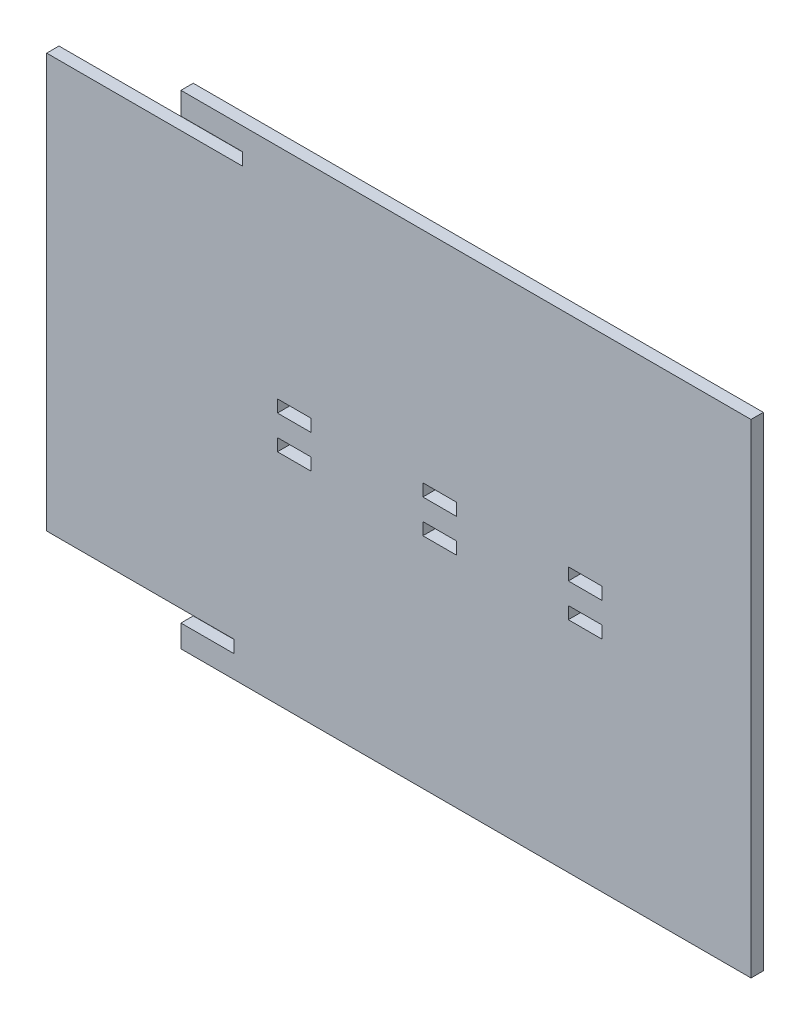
ISO-10303-21;
HEADER;
FILE_DESCRIPTION(('STEP AP214'),'2;1');
FILE_NAME('part.step','',(''),(''),'','','');
FILE_SCHEMA(('AUTOMOTIVE_DESIGN { 1 0 10303 214 1 1 1 1 }'));
ENDSEC;
DATA;
#1=APPLICATION_CONTEXT('core data for automotive mechanical design processes');
#2=APPLICATION_PROTOCOL_DEFINITION('international standard','automotive_design',2000,#1);
#3=PRODUCT_CONTEXT('',#1,'mechanical');
#4=PRODUCT('Part','Part','',(#3));
#5=PRODUCT_RELATED_PRODUCT_CATEGORY('part','',(#4));
#6=PRODUCT_DEFINITION_FORMATION('','',#4);
#7=PRODUCT_DEFINITION_CONTEXT('part definition',#1,'design');
#8=PRODUCT_DEFINITION('design','',#6,#7);
#9=PRODUCT_DEFINITION_SHAPE('','',#8);
#10=(LENGTH_UNIT() NAMED_UNIT(*) SI_UNIT(.MILLI.,.METRE.));
#11=(NAMED_UNIT(*) PLANE_ANGLE_UNIT() SI_UNIT($,.RADIAN.));
#12=(NAMED_UNIT(*) SI_UNIT($,.STERADIAN.) SOLID_ANGLE_UNIT());
#13=UNCERTAINTY_MEASURE_WITH_UNIT(LENGTH_MEASURE(1.E-05),#10,'distance_accuracy_value','');
#14=(GEOMETRIC_REPRESENTATION_CONTEXT(3) GLOBAL_UNCERTAINTY_ASSIGNED_CONTEXT((#13)) GLOBAL_UNIT_ASSIGNED_CONTEXT((#10,
#11,#12)) REPRESENTATION_CONTEXT('',''));
#15=CARTESIAN_POINT('',(0.,0.,0.));
#16=DIRECTION('',(0.,0.,1.));
#17=DIRECTION('',(1.,0.,0.));
#18=AXIS2_PLACEMENT_3D('',#15,#16,#17);
#19=CARTESIAN_POINT('',(0.,0.,5.5));
#20=DIRECTION('',(0.,0.,-1.));
#21=DIRECTION('',(-1.,0.,0.));
#22=AXIS2_PLACEMENT_3D('',#19,#20,#21);
#23=PLANE('',#22);
#24=DIRECTION('',(1.,0.,0.));
#25=VECTOR('',#24,1.);
#26=CARTESIAN_POINT('',(0.,-113.05,5.5));
#27=LINE('',#26,#25);
#28=CARTESIAN_POINT('',(-119.337001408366,-113.05,5.5));
#29=VERTEX_POINT('',#28);
#30=CARTESIAN_POINT('',(-104.337001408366,-113.05,5.5));
#31=VERTEX_POINT('',#30);
#32=EDGE_CURVE('E60',#29,#31,#27,.T.);
#33=ORIENTED_EDGE('',*,*,#32,.T.);
#34=DIRECTION('',(0.,1.,0.));
#35=VECTOR('',#34,1.);
#36=CARTESIAN_POINT('',(-104.337001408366,0.,5.5));
#37=LINE('',#36,#35);
#38=CARTESIAN_POINT('',(-104.337001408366,-118.55,5.5));
#39=VERTEX_POINT('',#38);
#40=EDGE_CURVE('E318',#39,#31,#37,.T.);
#41=ORIENTED_EDGE('',*,*,#40,.F.);
#42=DIRECTION('',(1.,0.,0.));
#43=VECTOR('',#42,1.);
#44=CARTESIAN_POINT('',(0.,-118.55,5.5));
#45=LINE('',#44,#43);
#46=CARTESIAN_POINT('',(-119.337001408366,-118.55,5.5));
#47=VERTEX_POINT('',#46);
#48=EDGE_CURVE('E332',#47,#39,#45,.T.);
#49=ORIENTED_EDGE('',*,*,#48,.F.);
#50=DIRECTION('',(0.,1.,0.));
#51=VECTOR('',#50,1.);
#52=CARTESIAN_POINT('',(-119.337001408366,0.,5.5));
#53=LINE('',#52,#51);
#54=EDGE_CURVE('E328',#47,#29,#53,.T.);
#55=ORIENTED_EDGE('',*,*,#54,.T.);
#56=EDGE_LOOP('',(#33,#41,#49,#55));
#57=FACE_BOUND('',#56,.T.);
#58=DIRECTION('',(0.,1.,0.));
#59=VECTOR('',#58,1.);
#60=CARTESIAN_POINT('',(-54.337001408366,0.,5.5));
#61=LINE('',#60,#59);
#62=CARTESIAN_POINT('',(-54.337001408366,-118.55,5.5));
#63=VERTEX_POINT('',#62);
#64=CARTESIAN_POINT('',(-54.337001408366,-113.05,5.5));
#65=VERTEX_POINT('',#64);
#66=EDGE_CURVE('E384',#63,#65,#61,.T.);
#67=ORIENTED_EDGE('',*,*,#66,.T.);
#68=DIRECTION('',(1.,0.,0.));
#69=VECTOR('',#68,1.);
#70=CARTESIAN_POINT('',(0.,-113.05,5.5));
#71=LINE('',#70,#69);
#72=CARTESIAN_POINT('',(-39.337001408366,-113.05,5.5));
#73=VERTEX_POINT('',#72);
#74=EDGE_CURVE('E375',#65,#73,#71,.T.);
#75=ORIENTED_EDGE('',*,*,#74,.T.);
#76=DIRECTION('',(0.,1.,0.));
#77=VECTOR('',#76,1.);
#78=CARTESIAN_POINT('',(-39.337001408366,0.,5.5));
#79=LINE('',#78,#77);
#80=CARTESIAN_POINT('',(-39.337001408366,-118.55,5.5));
#81=VERTEX_POINT('',#80);
#82=EDGE_CURVE('E391',#81,#73,#79,.T.);
#83=ORIENTED_EDGE('',*,*,#82,.F.);
#84=DIRECTION('',(1.,0.,0.));
#85=VECTOR('',#84,1.);
#86=CARTESIAN_POINT('',(-1.09680782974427E-13,-118.55,5.5));
#87=LINE('',#86,#85);
#88=EDGE_CURVE('E387',#63,#81,#87,.T.);
#89=ORIENTED_EDGE('',*,*,#88,.F.);
#90=EDGE_LOOP('',(#67,#75,#83,#89));
#91=FACE_BOUND('',#90,.T.);
#92=DIRECTION('',(0.,-1.,0.));
#93=VECTOR('',#92,1.);
#94=CARTESIAN_POINT('',(-39.337001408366,0.,5.5));
#95=LINE('',#94,#93);
#96=CARTESIAN_POINT('',(-39.337001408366,-98.0500000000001,5.5));
#97=VERTEX_POINT('',#96);
#98=CARTESIAN_POINT('',(-39.337001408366,-103.55,5.5));
#99=VERTEX_POINT('',#98);
#100=EDGE_CURVE('E399',#97,#99,#95,.T.);
#101=ORIENTED_EDGE('',*,*,#100,.T.);
#102=DIRECTION('',(1.,0.,0.));
#103=VECTOR('',#102,1.);
#104=CARTESIAN_POINT('',(0.,-103.55,5.5));
#105=LINE('',#104,#103);
#106=CARTESIAN_POINT('',(-54.337001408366,-103.55,5.5));
#107=VERTEX_POINT('',#106);
#108=EDGE_CURVE('E438',#107,#99,#105,.T.);
#109=ORIENTED_EDGE('',*,*,#108,.F.);
#110=DIRECTION('',(0.,-1.,0.));
#111=VECTOR('',#110,1.);
#112=CARTESIAN_POINT('',(-54.337001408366,0.,5.5));
#113=LINE('',#112,#111);
#114=CARTESIAN_POINT('',(-54.337001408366,-98.0500000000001,5.5));
#115=VERTEX_POINT('',#114);
#116=EDGE_CURVE('E452',#115,#107,#113,.T.);
#117=ORIENTED_EDGE('',*,*,#116,.F.);
#118=DIRECTION('',(1.,0.,0.));
#119=VECTOR('',#118,1.);
#120=CARTESIAN_POINT('',(0.,-98.0500000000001,5.5));
#121=LINE('',#120,#119);
#122=EDGE_CURVE('E449',#115,#97,#121,.T.);
#123=ORIENTED_EDGE('',*,*,#122,.T.);
#124=EDGE_LOOP('',(#101,#109,#117,#123));
#125=FACE_BOUND('',#124,.T.);
#126=DIRECTION('',(-1.,0.,0.));
#127=VECTOR('',#126,1.);
#128=CARTESIAN_POINT('',(-227.473920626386,-0.200000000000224,5.5));
#129=LINE('',#128,#127);
#130=CARTESIAN_POINT('',(27.3311582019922,-0.20000000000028,5.5));
#131=VERTEX_POINT('',#130);
#132=CARTESIAN_POINT('',(-227.473920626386,-0.200000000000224,5.5));
#133=VERTEX_POINT('',#132);
#134=EDGE_CURVE('E466',#131,#133,#129,.T.);
#135=ORIENTED_EDGE('',*,*,#134,.T.);
#136=DIRECTION('',(0.,-1.,0.));
#137=VECTOR('',#136,1.);
#138=CARTESIAN_POINT('',(-227.473920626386,-10.2000000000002,5.5));
#139=LINE('',#138,#137);
#140=CARTESIAN_POINT('',(-227.473920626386,-10.2000000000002,5.5));
#141=VERTEX_POINT('',#140);
#142=EDGE_CURVE('E469',#133,#141,#139,.T.);
#143=ORIENTED_EDGE('',*,*,#142,.T.);
#144=DIRECTION('',(1.,0.,0.));
#145=VECTOR('',#144,1.);
#146=CARTESIAN_POINT('',(-200.,-10.2000000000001,5.5));
#147=LINE('',#146,#145);
#148=CARTESIAN_POINT('',(-200.,-10.2000000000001,5.5));
#149=VERTEX_POINT('',#148);
#150=EDGE_CURVE('E472',#141,#149,#147,.T.);
#151=ORIENTED_EDGE('',*,*,#150,.T.);
#152=DIRECTION('',(0.,-1.,0.));
#153=VECTOR('',#152,1.);
#154=CARTESIAN_POINT('',(-200.,-15.8000000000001,5.5));
#155=LINE('',#154,#153);
#156=CARTESIAN_POINT('',(-200.,-15.8000000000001,5.5));
#157=VERTEX_POINT('',#156);
#158=EDGE_CURVE('E474',#149,#157,#155,.T.);
#159=ORIENTED_EDGE('',*,*,#158,.T.);
#160=DIRECTION('',(-1.,0.,0.));
#161=VECTOR('',#160,1.);
#162=CARTESIAN_POINT('',(-287.473920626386,-15.8000000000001,5.5));
#163=LINE('',#162,#161);
#164=CARTESIAN_POINT('',(-287.473920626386,-15.8000000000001,5.5));
#165=VERTEX_POINT('',#164);
#166=EDGE_CURVE('E476',#157,#165,#163,.T.);
#167=ORIENTED_EDGE('',*,*,#166,.T.);
#168=DIRECTION('',(0.,-1.,0.));
#169=VECTOR('',#168,1.);
#170=CARTESIAN_POINT('',(-287.473920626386,-200.8,5.5));
#171=LINE('',#170,#169);
#172=CARTESIAN_POINT('',(-287.473920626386,-200.8,5.5));
#173=VERTEX_POINT('',#172);
#174=EDGE_CURVE('E478',#165,#173,#171,.T.);
#175=ORIENTED_EDGE('',*,*,#174,.T.);
#176=DIRECTION('',(1.,0.,0.));
#177=VECTOR('',#176,1.);
#178=CARTESIAN_POINT('',(-203.831058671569,-200.8,5.5));
#179=LINE('',#178,#177);
#180=CARTESIAN_POINT('',(-203.831058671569,-200.8,5.5));
#181=VERTEX_POINT('',#180);
#182=EDGE_CURVE('E480',#173,#181,#179,.T.);
#183=ORIENTED_EDGE('',*,*,#182,.T.);
#184=DIRECTION('',(0.,-1.,0.));
#185=VECTOR('',#184,1.);
#186=CARTESIAN_POINT('',(-203.831058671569,-206.4,5.5));
#187=LINE('',#186,#185);
#188=CARTESIAN_POINT('',(-203.831058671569,-206.4,5.5));
#189=VERTEX_POINT('',#188);
#190=EDGE_CURVE('E482',#181,#189,#187,.T.);
#191=ORIENTED_EDGE('',*,*,#190,.T.);
#192=DIRECTION('',(-1.,0.,0.));
#193=VECTOR('',#192,1.);
#194=CARTESIAN_POINT('',(-227.473920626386,-206.4,5.5));
#195=LINE('',#194,#193);
#196=CARTESIAN_POINT('',(-227.473920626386,-206.4,5.5));
#197=VERTEX_POINT('',#196);
#198=EDGE_CURVE('E484',#189,#197,#195,.T.);
#199=ORIENTED_EDGE('',*,*,#198,.T.);
#200=DIRECTION('',(0.,-1.,0.));
#201=VECTOR('',#200,1.);
#202=CARTESIAN_POINT('',(-227.473920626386,-216.4,5.5));
#203=LINE('',#202,#201);
#204=CARTESIAN_POINT('',(-227.473920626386,-216.4,5.5));
#205=VERTEX_POINT('',#204);
#206=EDGE_CURVE('E486',#197,#205,#203,.T.);
#207=ORIENTED_EDGE('',*,*,#206,.T.);
#208=DIRECTION('',(1.,0.,0.));
#209=VECTOR('',#208,1.);
#210=CARTESIAN_POINT('',(27.3311582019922,-216.4,5.5));
#211=LINE('',#210,#209);
#212=CARTESIAN_POINT('',(27.3311582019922,-216.4,5.5));
#213=VERTEX_POINT('',#212);
#214=EDGE_CURVE('E488',#205,#213,#211,.T.);
#215=ORIENTED_EDGE('',*,*,#214,.T.);
#216=DIRECTION('',(0.,1.,0.));
#217=VECTOR('',#216,1.);
#218=CARTESIAN_POINT('',(27.3311582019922,-0.20000000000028,5.5));
#219=LINE('',#218,#217);
#220=EDGE_CURVE('E490',#213,#131,#219,.T.);
#221=ORIENTED_EDGE('',*,*,#220,.T.);
#222=EDGE_LOOP('',(#135,#143,#151,#159,#167,#175,#183,#191,#199,#207,#215,#221));
#223=FACE_BOUND('',#222,.T.);
#224=DIRECTION('',(0.,-1.,0.));
#225=VECTOR('',#224,1.);
#226=CARTESIAN_POINT('',(-169.337001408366,0.,5.5));
#227=LINE('',#226,#225);
#228=CARTESIAN_POINT('',(-169.337001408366,-98.0500000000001,5.5));
#229=VERTEX_POINT('',#228);
#230=CARTESIAN_POINT('',(-169.337001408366,-103.55,5.5));
#231=VERTEX_POINT('',#230);
#232=EDGE_CURVE('E290',#229,#231,#227,.T.);
#233=ORIENTED_EDGE('',*,*,#232,.T.);
#234=DIRECTION('',(1.,0.,0.));
#235=VECTOR('',#234,1.);
#236=CARTESIAN_POINT('',(0.,-103.55,5.5));
#237=LINE('',#236,#235);
#238=CARTESIAN_POINT('',(-184.337001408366,-103.55,5.5));
#239=VERTEX_POINT('',#238);
#240=EDGE_CURVE('E297',#239,#231,#237,.T.);
#241=ORIENTED_EDGE('',*,*,#240,.F.);
#242=DIRECTION('',(0.,-1.,0.));
#243=VECTOR('',#242,1.);
#244=CARTESIAN_POINT('',(-184.337001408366,0.,5.5));
#245=LINE('',#244,#243);
#246=CARTESIAN_POINT('',(-184.337001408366,-98.0500000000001,5.5));
#247=VERTEX_POINT('',#246);
#248=EDGE_CURVE('E300',#247,#239,#245,.T.);
#249=ORIENTED_EDGE('',*,*,#248,.F.);
#250=DIRECTION('',(1.,0.,0.));
#251=VECTOR('',#250,1.);
#252=CARTESIAN_POINT('',(0.,-98.0500000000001,5.5));
#253=LINE('',#252,#251);
#254=EDGE_CURVE('E306',#247,#229,#253,.T.);
#255=ORIENTED_EDGE('',*,*,#254,.T.);
#256=EDGE_LOOP('',(#233,#241,#249,#255));
#257=FACE_BOUND('',#256,.T.);
#258=DIRECTION('',(0.,-1.,0.));
#259=VECTOR('',#258,1.);
#260=CARTESIAN_POINT('',(-104.337001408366,0.,5.5));
#261=LINE('',#260,#259);
#262=CARTESIAN_POINT('',(-104.337001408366,-98.0500000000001,5.5));
#263=VERTEX_POINT('',#262);
#264=CARTESIAN_POINT('',(-104.337001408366,-103.55,5.5));
#265=VERTEX_POINT('',#264);
#266=EDGE_CURVE('E339',#263,#265,#261,.T.);
#267=ORIENTED_EDGE('',*,*,#266,.T.);
#268=DIRECTION('',(1.,0.,0.));
#269=VECTOR('',#268,1.);
#270=CARTESIAN_POINT('',(0.,-103.55,5.5));
#271=LINE('',#270,#269);
#272=CARTESIAN_POINT('',(-119.337001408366,-103.55,5.5));
#273=VERTEX_POINT('',#272);
#274=EDGE_CURVE('E409',#273,#265,#271,.T.);
#275=ORIENTED_EDGE('',*,*,#274,.F.);
#276=DIRECTION('',(0.,-1.,0.));
#277=VECTOR('',#276,1.);
#278=CARTESIAN_POINT('',(-119.337001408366,0.,5.5));
#279=LINE('',#278,#277);
#280=CARTESIAN_POINT('',(-119.337001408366,-98.0500000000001,5.5));
#281=VERTEX_POINT('',#280);
#282=EDGE_CURVE('E423',#281,#273,#279,.T.);
#283=ORIENTED_EDGE('',*,*,#282,.F.);
#284=DIRECTION('',(1.,0.,0.));
#285=VECTOR('',#284,1.);
#286=CARTESIAN_POINT('',(0.,-98.0500000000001,5.5));
#287=LINE('',#286,#285);
#288=EDGE_CURVE('E420',#281,#263,#287,.T.);
#289=ORIENTED_EDGE('',*,*,#288,.T.);
#290=EDGE_LOOP('',(#267,#275,#283,#289));
#291=FACE_BOUND('',#290,.T.);
#292=DIRECTION('',(1.,0.,0.));
#293=VECTOR('',#292,1.);
#294=CARTESIAN_POINT('',(0.,-113.05,5.5));
#295=LINE('',#294,#293);
#296=CARTESIAN_POINT('',(-184.337001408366,-113.05,5.5));
#297=VERTEX_POINT('',#296);
#298=CARTESIAN_POINT('',(-169.337001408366,-113.05,5.5));
#299=VERTEX_POINT('',#298);
#300=EDGE_CURVE('E52',#297,#299,#295,.T.);
#301=ORIENTED_EDGE('',*,*,#300,.T.);
#302=DIRECTION('',(0.,1.,0.));
#303=VECTOR('',#302,1.);
#304=CARTESIAN_POINT('',(-169.337001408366,0.,5.5));
#305=LINE('',#304,#303);
#306=CARTESIAN_POINT('',(-169.337001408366,-118.55,5.5));
#307=VERTEX_POINT('',#306);
#308=EDGE_CURVE('E348',#307,#299,#305,.T.);
#309=ORIENTED_EDGE('',*,*,#308,.F.);
#310=DIRECTION('',(1.,0.,0.));
#311=VECTOR('',#310,1.);
#312=CARTESIAN_POINT('',(0.,-118.55,5.5));
#313=LINE('',#312,#311);
#314=CARTESIAN_POINT('',(-184.337001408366,-118.55,5.5));
#315=VERTEX_POINT('',#314);
#316=EDGE_CURVE('E361',#315,#307,#313,.T.);
#317=ORIENTED_EDGE('',*,*,#316,.F.);
#318=DIRECTION('',(0.,1.,0.));
#319=VECTOR('',#318,1.);
#320=CARTESIAN_POINT('',(-184.337001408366,0.,5.5));
#321=LINE('',#320,#319);
#322=EDGE_CURVE('E358',#315,#297,#321,.T.);
#323=ORIENTED_EDGE('',*,*,#322,.T.);
#324=EDGE_LOOP('',(#301,#309,#317,#323));
#325=FACE_BOUND('',#324,.T.);
#326=ADVANCED_FACE('F37',(#57,#91,#125,#223,#257,#291,#325),#23,.F.);
#327=CARTESIAN_POINT('',(0.,0.,0.));
#328=DIRECTION('',(0.,0.,-1.));
#329=DIRECTION('',(-1.,0.,0.));
#330=AXIS2_PLACEMENT_3D('',#327,#328,#329);
#331=PLANE('',#330);
#332=DIRECTION('',(-1.,0.,0.));
#333=VECTOR('',#332,1.);
#334=CARTESIAN_POINT('',(-227.473920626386,-0.200000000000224,0.));
#335=LINE('',#334,#333);
#336=CARTESIAN_POINT('',(27.3311582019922,-0.20000000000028,0.));
#337=VERTEX_POINT('',#336);
#338=CARTESIAN_POINT('',(-227.473920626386,-0.200000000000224,0.));
#339=VERTEX_POINT('',#338);
#340=EDGE_CURVE('E459',#337,#339,#335,.T.);
#341=ORIENTED_EDGE('',*,*,#340,.F.);
#342=DIRECTION('',(0.,1.,0.));
#343=VECTOR('',#342,1.);
#344=CARTESIAN_POINT('',(27.3311582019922,-0.20000000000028,0.));
#345=LINE('',#344,#343);
#346=CARTESIAN_POINT('',(27.3311582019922,-216.4,0.));
#347=VERTEX_POINT('',#346);
#348=EDGE_CURVE('E470',#347,#337,#345,.T.);
#349=ORIENTED_EDGE('',*,*,#348,.F.);
#350=DIRECTION('',(1.,0.,0.));
#351=VECTOR('',#350,1.);
#352=CARTESIAN_POINT('',(27.3311582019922,-216.4,0.));
#353=LINE('',#352,#351);
#354=CARTESIAN_POINT('',(-227.473920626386,-216.4,0.));
#355=VERTEX_POINT('',#354);
#356=EDGE_CURVE('E513',#355,#347,#353,.T.);
#357=ORIENTED_EDGE('',*,*,#356,.F.);
#358=DIRECTION('',(0.,-1.,0.));
#359=VECTOR('',#358,1.);
#360=CARTESIAN_POINT('',(-227.473920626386,-216.4,0.));
#361=LINE('',#360,#359);
#362=CARTESIAN_POINT('',(-227.473920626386,-206.4,0.));
#363=VERTEX_POINT('',#362);
#364=EDGE_CURVE('E511',#363,#355,#361,.T.);
#365=ORIENTED_EDGE('',*,*,#364,.F.);
#366=DIRECTION('',(-1.,0.,0.));
#367=VECTOR('',#366,1.);
#368=CARTESIAN_POINT('',(-227.473920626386,-206.4,0.));
#369=LINE('',#368,#367);
#370=CARTESIAN_POINT('',(-203.831058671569,-206.4,0.));
#371=VERTEX_POINT('',#370);
#372=EDGE_CURVE('E509',#371,#363,#369,.T.);
#373=ORIENTED_EDGE('',*,*,#372,.F.);
#374=DIRECTION('',(0.,-1.,0.));
#375=VECTOR('',#374,1.);
#376=CARTESIAN_POINT('',(-203.831058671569,-206.4,0.));
#377=LINE('',#376,#375);
#378=CARTESIAN_POINT('',(-203.831058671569,-200.8,0.));
#379=VERTEX_POINT('',#378);
#380=EDGE_CURVE('E507',#379,#371,#377,.T.);
#381=ORIENTED_EDGE('',*,*,#380,.F.);
#382=DIRECTION('',(1.,0.,0.));
#383=VECTOR('',#382,1.);
#384=CARTESIAN_POINT('',(-203.831058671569,-200.8,0.));
#385=LINE('',#384,#383);
#386=CARTESIAN_POINT('',(-287.473920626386,-200.8,0.));
#387=VERTEX_POINT('',#386);
#388=EDGE_CURVE('E505',#387,#379,#385,.T.);
#389=ORIENTED_EDGE('',*,*,#388,.F.);
#390=DIRECTION('',(0.,-1.,0.));
#391=VECTOR('',#390,1.);
#392=CARTESIAN_POINT('',(-287.473920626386,-200.8,0.));
#393=LINE('',#392,#391);
#394=CARTESIAN_POINT('',(-287.473920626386,-15.8000000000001,0.));
#395=VERTEX_POINT('',#394);
#396=EDGE_CURVE('E503',#395,#387,#393,.T.);
#397=ORIENTED_EDGE('',*,*,#396,.F.);
#398=DIRECTION('',(-1.,0.,0.));
#399=VECTOR('',#398,1.);
#400=CARTESIAN_POINT('',(-287.473920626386,-15.8000000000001,0.));
#401=LINE('',#400,#399);
#402=CARTESIAN_POINT('',(-200.,-15.8000000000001,0.));
#403=VERTEX_POINT('',#402);
#404=EDGE_CURVE('E501',#403,#395,#401,.T.);
#405=ORIENTED_EDGE('',*,*,#404,.F.);
#406=DIRECTION('',(0.,-1.,0.));
#407=VECTOR('',#406,1.);
#408=CARTESIAN_POINT('',(-200.,-15.8000000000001,0.));
#409=LINE('',#408,#407);
#410=CARTESIAN_POINT('',(-200.,-10.2000000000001,0.));
#411=VERTEX_POINT('',#410);
#412=EDGE_CURVE('E499',#411,#403,#409,.T.);
#413=ORIENTED_EDGE('',*,*,#412,.F.);
#414=DIRECTION('',(1.,0.,0.));
#415=VECTOR('',#414,1.);
#416=CARTESIAN_POINT('',(-200.,-10.2000000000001,0.));
#417=LINE('',#416,#415);
#418=CARTESIAN_POINT('',(-227.473920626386,-10.2000000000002,0.));
#419=VERTEX_POINT('',#418);
#420=EDGE_CURVE('E497',#419,#411,#417,.T.);
#421=ORIENTED_EDGE('',*,*,#420,.F.);
#422=DIRECTION('',(0.,-1.,0.));
#423=VECTOR('',#422,1.);
#424=CARTESIAN_POINT('',(-227.473920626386,-10.2000000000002,0.));
#425=LINE('',#424,#423);
#426=EDGE_CURVE('E495',#339,#419,#425,.T.);
#427=ORIENTED_EDGE('',*,*,#426,.F.);
#428=EDGE_LOOP('',(#341,#349,#357,#365,#373,#381,#389,#397,#405,#413,#421,#427));
#429=FACE_BOUND('',#428,.T.);
#430=DIRECTION('',(1.,0.,0.));
#431=VECTOR('',#430,1.);
#432=CARTESIAN_POINT('',(0.,-103.55,0.));
#433=LINE('',#432,#431);
#434=CARTESIAN_POINT('',(-54.337001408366,-103.55,0.));
#435=VERTEX_POINT('',#434);
#436=CARTESIAN_POINT('',(-39.337001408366,-103.55,0.));
#437=VERTEX_POINT('',#436);
#438=EDGE_CURVE('E443',#435,#437,#433,.T.);
#439=ORIENTED_EDGE('',*,*,#438,.T.);
#440=DIRECTION('',(0.,-1.,0.));
#441=VECTOR('',#440,1.);
#442=CARTESIAN_POINT('',(-39.337001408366,0.,0.));
#443=LINE('',#442,#441);
#444=CARTESIAN_POINT('',(-39.337001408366,-98.0500000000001,0.));
#445=VERTEX_POINT('',#444);
#446=EDGE_CURVE('E435',#445,#437,#443,.T.);
#447=ORIENTED_EDGE('',*,*,#446,.F.);
#448=DIRECTION('',(1.,0.,0.));
#449=VECTOR('',#448,1.);
#450=CARTESIAN_POINT('',(0.,-98.0500000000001,0.));
#451=LINE('',#450,#449);
#452=CARTESIAN_POINT('',(-54.337001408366,-98.0500000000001,0.));
#453=VERTEX_POINT('',#452);
#454=EDGE_CURVE('E437',#453,#445,#451,.T.);
#455=ORIENTED_EDGE('',*,*,#454,.F.);
#456=DIRECTION('',(0.,-1.,0.));
#457=VECTOR('',#456,1.);
#458=CARTESIAN_POINT('',(-54.337001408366,0.,0.));
#459=LINE('',#458,#457);
#460=EDGE_CURVE('E440',#453,#435,#459,.T.);
#461=ORIENTED_EDGE('',*,*,#460,.T.);
#462=EDGE_LOOP('',(#439,#447,#455,#461));
#463=FACE_BOUND('',#462,.T.);
#464=DIRECTION('',(1.,0.,0.));
#465=VECTOR('',#464,1.);
#466=CARTESIAN_POINT('',(0.,-103.55,0.));
#467=LINE('',#466,#465);
#468=CARTESIAN_POINT('',(-184.337001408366,-103.55,0.));
#469=VERTEX_POINT('',#468);
#470=CARTESIAN_POINT('',(-169.337001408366,-103.55,0.));
#471=VERTEX_POINT('',#470);
#472=EDGE_CURVE('E291',#469,#471,#467,.T.);
#473=ORIENTED_EDGE('',*,*,#472,.T.);
#474=DIRECTION('',(0.,-1.,0.));
#475=VECTOR('',#474,1.);
#476=CARTESIAN_POINT('',(-169.337001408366,0.,0.));
#477=LINE('',#476,#475);
#478=CARTESIAN_POINT('',(-169.337001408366,-98.0500000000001,0.));
#479=VERTEX_POINT('',#478);
#480=EDGE_CURVE('E284',#479,#471,#477,.T.);
#481=ORIENTED_EDGE('',*,*,#480,.F.);
#482=DIRECTION('',(1.,0.,0.));
#483=VECTOR('',#482,1.);
#484=CARTESIAN_POINT('',(0.,-98.0500000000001,0.));
#485=LINE('',#484,#483);
#486=CARTESIAN_POINT('',(-184.337001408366,-98.0500000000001,0.));
#487=VERTEX_POINT('',#486);
#488=EDGE_CURVE('E273',#487,#479,#485,.T.);
#489=ORIENTED_EDGE('',*,*,#488,.F.);
#490=DIRECTION('',(0.,-1.,0.));
#491=VECTOR('',#490,1.);
#492=CARTESIAN_POINT('',(-184.337001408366,0.,0.));
#493=LINE('',#492,#491);
#494=EDGE_CURVE('E283',#487,#469,#493,.T.);
#495=ORIENTED_EDGE('',*,*,#494,.T.);
#496=EDGE_LOOP('',(#473,#481,#489,#495));
#497=FACE_BOUND('',#496,.T.);
#498=DIRECTION('',(1.,0.,0.));
#499=VECTOR('',#498,1.);
#500=CARTESIAN_POINT('',(0.,-113.05,0.));
#501=LINE('',#500,#499);
#502=CARTESIAN_POINT('',(-54.337001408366,-113.05,0.));
#503=VERTEX_POINT('',#502);
#504=CARTESIAN_POINT('',(-39.337001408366,-113.05,0.));
#505=VERTEX_POINT('',#504);
#506=EDGE_CURVE('E381',#503,#505,#501,.T.);
#507=ORIENTED_EDGE('',*,*,#506,.F.);
#508=DIRECTION('',(0.,1.,0.));
#509=VECTOR('',#508,1.);
#510=CARTESIAN_POINT('',(-54.337001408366,0.,0.));
#511=LINE('',#510,#509);
#512=CARTESIAN_POINT('',(-54.337001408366,-118.55,0.));
#513=VERTEX_POINT('',#512);
#514=EDGE_CURVE('E372',#513,#503,#511,.T.);
#515=ORIENTED_EDGE('',*,*,#514,.F.);
#516=DIRECTION('',(1.,0.,0.));
#517=VECTOR('',#516,1.);
#518=CARTESIAN_POINT('',(-1.09680782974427E-13,-118.55,0.));
#519=LINE('',#518,#517);
#520=CARTESIAN_POINT('',(-39.337001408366,-118.55,0.));
#521=VERTEX_POINT('',#520);
#522=EDGE_CURVE('E374',#513,#521,#519,.T.);
#523=ORIENTED_EDGE('',*,*,#522,.T.);
#524=DIRECTION('',(0.,1.,0.));
#525=VECTOR('',#524,1.);
#526=CARTESIAN_POINT('',(-39.337001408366,0.,0.));
#527=LINE('',#526,#525);
#528=EDGE_CURVE('E378',#521,#505,#527,.T.);
#529=ORIENTED_EDGE('',*,*,#528,.T.);
#530=EDGE_LOOP('',(#507,#515,#523,#529));
#531=FACE_BOUND('',#530,.T.);
#532=DIRECTION('',(1.,0.,0.));
#533=VECTOR('',#532,1.);
#534=CARTESIAN_POINT('',(0.,-103.55,0.));
#535=LINE('',#534,#533);
#536=CARTESIAN_POINT('',(-119.337001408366,-103.55,0.));
#537=VERTEX_POINT('',#536);
#538=CARTESIAN_POINT('',(-104.337001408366,-103.55,0.));
#539=VERTEX_POINT('',#538);
#540=EDGE_CURVE('E414',#537,#539,#535,.T.);
#541=ORIENTED_EDGE('',*,*,#540,.T.);
#542=DIRECTION('',(0.,-1.,0.));
#543=VECTOR('',#542,1.);
#544=CARTESIAN_POINT('',(-104.337001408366,0.,0.));
#545=LINE('',#544,#543);
#546=CARTESIAN_POINT('',(-104.337001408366,-98.0500000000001,0.));
#547=VERTEX_POINT('',#546);
#548=EDGE_CURVE('E406',#547,#539,#545,.T.);
#549=ORIENTED_EDGE('',*,*,#548,.F.);
#550=DIRECTION('',(1.,0.,0.));
#551=VECTOR('',#550,1.);
#552=CARTESIAN_POINT('',(0.,-98.0500000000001,0.));
#553=LINE('',#552,#551);
#554=CARTESIAN_POINT('',(-119.337001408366,-98.0500000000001,0.));
#555=VERTEX_POINT('',#554);
#556=EDGE_CURVE('E408',#555,#547,#553,.T.);
#557=ORIENTED_EDGE('',*,*,#556,.F.);
#558=DIRECTION('',(0.,-1.,0.));
#559=VECTOR('',#558,1.);
#560=CARTESIAN_POINT('',(-119.337001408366,0.,0.));
#561=LINE('',#560,#559);
#562=EDGE_CURVE('E411',#555,#537,#561,.T.);
#563=ORIENTED_EDGE('',*,*,#562,.T.);
#564=EDGE_LOOP('',(#541,#549,#557,#563));
#565=FACE_BOUND('',#564,.T.);
#566=DIRECTION('',(0.,1.,0.));
#567=VECTOR('',#566,1.);
#568=CARTESIAN_POINT('',(-104.337001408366,0.,0.));
#569=LINE('',#568,#567);
#570=CARTESIAN_POINT('',(-104.337001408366,-118.55,0.));
#571=VERTEX_POINT('',#570);
#572=CARTESIAN_POINT('',(-104.337001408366,-113.05,0.));
#573=VERTEX_POINT('',#572);
#574=EDGE_CURVE('E323',#571,#573,#569,.T.);
#575=ORIENTED_EDGE('',*,*,#574,.T.);
#576=DIRECTION('',(1.,0.,0.));
#577=VECTOR('',#576,1.);
#578=CARTESIAN_POINT('',(0.,-113.05,0.));
#579=LINE('',#578,#577);
#580=CARTESIAN_POINT('',(-119.337001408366,-113.05,0.));
#581=VERTEX_POINT('',#580);
#582=EDGE_CURVE('E315',#581,#573,#579,.T.);
#583=ORIENTED_EDGE('',*,*,#582,.F.);
#584=DIRECTION('',(0.,1.,0.));
#585=VECTOR('',#584,1.);
#586=CARTESIAN_POINT('',(-119.337001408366,0.,0.));
#587=LINE('',#586,#585);
#588=CARTESIAN_POINT('',(-119.337001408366,-118.55,0.));
#589=VERTEX_POINT('',#588);
#590=EDGE_CURVE('E317',#589,#581,#587,.T.);
#591=ORIENTED_EDGE('',*,*,#590,.F.);
#592=DIRECTION('',(1.,0.,0.));
#593=VECTOR('',#592,1.);
#594=CARTESIAN_POINT('',(0.,-118.55,0.));
#595=LINE('',#594,#593);
#596=EDGE_CURVE('E320',#589,#571,#595,.T.);
#597=ORIENTED_EDGE('',*,*,#596,.T.);
#598=EDGE_LOOP('',(#575,#583,#591,#597));
#599=FACE_BOUND('',#598,.T.);
#600=DIRECTION('',(0.,1.,0.));
#601=VECTOR('',#600,1.);
#602=CARTESIAN_POINT('',(-169.337001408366,0.,0.));
#603=LINE('',#602,#601);
#604=CARTESIAN_POINT('',(-169.337001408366,-118.55,0.));
#605=VERTEX_POINT('',#604);
#606=CARTESIAN_POINT('',(-169.337001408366,-113.05,0.));
#607=VERTEX_POINT('',#606);
#608=EDGE_CURVE('E353',#605,#607,#603,.T.);
#609=ORIENTED_EDGE('',*,*,#608,.T.);
#610=DIRECTION('',(1.,0.,0.));
#611=VECTOR('',#610,1.);
#612=CARTESIAN_POINT('',(0.,-113.05,0.));
#613=LINE('',#612,#611);
#614=CARTESIAN_POINT('',(-184.337001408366,-113.05,0.));
#615=VERTEX_POINT('',#614);
#616=EDGE_CURVE('E345',#615,#607,#613,.T.);
#617=ORIENTED_EDGE('',*,*,#616,.F.);
#618=DIRECTION('',(0.,1.,0.));
#619=VECTOR('',#618,1.);
#620=CARTESIAN_POINT('',(-184.337001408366,0.,0.));
#621=LINE('',#620,#619);
#622=CARTESIAN_POINT('',(-184.337001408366,-118.55,0.));
#623=VERTEX_POINT('',#622);
#624=EDGE_CURVE('E347',#623,#615,#621,.T.);
#625=ORIENTED_EDGE('',*,*,#624,.F.);
#626=DIRECTION('',(1.,0.,0.));
#627=VECTOR('',#626,1.);
#628=CARTESIAN_POINT('',(0.,-118.55,0.));
#629=LINE('',#628,#627);
#630=EDGE_CURVE('E350',#623,#605,#629,.T.);
#631=ORIENTED_EDGE('',*,*,#630,.T.);
#632=EDGE_LOOP('',(#609,#617,#625,#631));
#633=FACE_BOUND('',#632,.T.);
#634=ADVANCED_FACE('F294',(#429,#463,#497,#531,#565,#599,#633),#331,.T.);
#635=CARTESIAN_POINT('',(-227.473920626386,-0.200000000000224,5.5));
#636=DIRECTION('',(0.,-1.,0.));
#637=DIRECTION('',(1.,0.,0.));
#638=AXIS2_PLACEMENT_3D('',#635,#636,#637);
#639=PLANE('',#638);
#640=ORIENTED_EDGE('',*,*,#340,.T.);
#641=DIRECTION('',(0.,0.,-1.));
#642=VECTOR('',#641,1.);
#643=CARTESIAN_POINT('',(-227.473920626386,-0.200000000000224,5.5));
#644=LINE('',#643,#642);
#645=EDGE_CURVE('E11',#133,#339,#644,.T.);
#646=ORIENTED_EDGE('',*,*,#645,.F.);
#647=ORIENTED_EDGE('',*,*,#134,.F.);
#648=DIRECTION('',(0.,0.,-1.));
#649=VECTOR('',#648,1.);
#650=CARTESIAN_POINT('',(27.3311582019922,-0.20000000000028,5.5));
#651=LINE('',#650,#649);
#652=EDGE_CURVE('E492',#131,#337,#651,.T.);
#653=ORIENTED_EDGE('',*,*,#652,.T.);
#654=EDGE_LOOP('',(#640,#646,#647,#653));
#655=FACE_BOUND('',#654,.T.);
#656=ADVANCED_FACE('F39',(#655),#639,.F.);
#657=CARTESIAN_POINT('',(-227.473920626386,-10.2000000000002,5.5));
#658=DIRECTION('',(1.,0.,0.));
#659=DIRECTION('',(0.,0.,-1.));
#660=AXIS2_PLACEMENT_3D('',#657,#658,#659);
#661=PLANE('',#660);
#662=ORIENTED_EDGE('',*,*,#426,.T.);
#663=DIRECTION('',(0.,0.,-1.));
#664=VECTOR('',#663,1.);
#665=CARTESIAN_POINT('',(-227.473920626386,-10.2000000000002,5.5));
#666=LINE('',#665,#664);
#667=EDGE_CURVE('E45',#141,#419,#666,.T.);
#668=ORIENTED_EDGE('',*,*,#667,.F.);
#669=ORIENTED_EDGE('',*,*,#142,.F.);
#670=ORIENTED_EDGE('',*,*,#645,.T.);
#671=EDGE_LOOP('',(#662,#668,#669,#670));
#672=FACE_BOUND('',#671,.T.);
#673=ADVANCED_FACE('F572',(#672),#661,.F.);
#674=CARTESIAN_POINT('',(-200.,-10.2000000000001,5.5));
#675=DIRECTION('',(0.,1.,0.));
#676=DIRECTION('',(-1.,0.,0.));
#677=AXIS2_PLACEMENT_3D('',#674,#675,#676);
#678=PLANE('',#677);
#679=ORIENTED_EDGE('',*,*,#420,.T.);
#680=DIRECTION('',(0.,0.,-1.));
#681=VECTOR('',#680,1.);
#682=CARTESIAN_POINT('',(-200.,-10.2000000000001,5.5));
#683=LINE('',#682,#681);
#684=EDGE_CURVE('E542',#149,#411,#683,.T.);
#685=ORIENTED_EDGE('',*,*,#684,.F.);
#686=ORIENTED_EDGE('',*,*,#150,.F.);
#687=ORIENTED_EDGE('',*,*,#667,.T.);
#688=EDGE_LOOP('',(#679,#685,#686,#687));
#689=FACE_BOUND('',#688,.T.);
#690=ADVANCED_FACE('F549',(#689),#678,.F.);
#691=CARTESIAN_POINT('',(-200.,-15.8000000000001,5.5));
#692=DIRECTION('',(1.,0.,0.));
#693=DIRECTION('',(0.,1.,0.));
#694=AXIS2_PLACEMENT_3D('',#691,#692,#693);
#695=PLANE('',#694);
#696=ORIENTED_EDGE('',*,*,#412,.T.);
#697=DIRECTION('',(0.,0.,-1.));
#698=VECTOR('',#697,1.);
#699=CARTESIAN_POINT('',(-200.,-15.8000000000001,5.5));
#700=LINE('',#699,#698);
#701=EDGE_CURVE('E539',#157,#403,#700,.T.);
#702=ORIENTED_EDGE('',*,*,#701,.F.);
#703=ORIENTED_EDGE('',*,*,#158,.F.);
#704=ORIENTED_EDGE('',*,*,#684,.T.);
#705=EDGE_LOOP('',(#696,#702,#703,#704));
#706=FACE_BOUND('',#705,.T.);
#707=ADVANCED_FACE('F560',(#706),#695,.F.);
#708=CARTESIAN_POINT('',(-287.473920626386,-15.8000000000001,5.5));
#709=DIRECTION('',(0.,-1.,0.));
#710=DIRECTION('',(0.,0.,-1.));
#711=AXIS2_PLACEMENT_3D('',#708,#709,#710);
#712=PLANE('',#711);
#713=ORIENTED_EDGE('',*,*,#404,.T.);
#714=DIRECTION('',(0.,0.,-1.));
#715=VECTOR('',#714,1.);
#716=CARTESIAN_POINT('',(-287.473920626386,-15.8000000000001,5.5));
#717=LINE('',#716,#715);
#718=EDGE_CURVE('E536',#165,#395,#717,.T.);
#719=ORIENTED_EDGE('',*,*,#718,.F.);
#720=ORIENTED_EDGE('',*,*,#166,.F.);
#721=ORIENTED_EDGE('',*,*,#701,.T.);
#722=EDGE_LOOP('',(#713,#719,#720,#721));
#723=FACE_BOUND('',#722,.T.);
#724=ADVANCED_FACE('F564',(#723),#712,.F.);
#725=CARTESIAN_POINT('',(-287.473920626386,-200.8,5.5));
#726=DIRECTION('',(1.,0.,0.));
#727=DIRECTION('',(0.,0.,-1.));
#728=AXIS2_PLACEMENT_3D('',#725,#726,#727);
#729=PLANE('',#728);
#730=ORIENTED_EDGE('',*,*,#396,.T.);
#731=DIRECTION('',(0.,0.,-1.));
#732=VECTOR('',#731,1.);
#733=CARTESIAN_POINT('',(-287.473920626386,-200.8,5.5));
#734=LINE('',#733,#732);
#735=EDGE_CURVE('E533',#173,#387,#734,.T.);
#736=ORIENTED_EDGE('',*,*,#735,.F.);
#737=ORIENTED_EDGE('',*,*,#174,.F.);
#738=ORIENTED_EDGE('',*,*,#718,.T.);
#739=EDGE_LOOP('',(#730,#736,#737,#738));
#740=FACE_BOUND('',#739,.T.);
#741=ADVANCED_FACE('F605',(#740),#729,.F.);
#742=CARTESIAN_POINT('',(-203.831058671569,-200.8,5.5));
#743=DIRECTION('',(0.,1.,0.));
#744=DIRECTION('',(0.,0.,1.));
#745=AXIS2_PLACEMENT_3D('',#742,#743,#744);
#746=PLANE('',#745);
#747=ORIENTED_EDGE('',*,*,#388,.T.);
#748=DIRECTION('',(0.,0.,-1.));
#749=VECTOR('',#748,1.);
#750=CARTESIAN_POINT('',(-203.831058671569,-200.8,5.5));
#751=LINE('',#750,#749);
#752=EDGE_CURVE('E530',#181,#379,#751,.T.);
#753=ORIENTED_EDGE('',*,*,#752,.F.);
#754=ORIENTED_EDGE('',*,*,#182,.F.);
#755=ORIENTED_EDGE('',*,*,#735,.T.);
#756=EDGE_LOOP('',(#747,#753,#754,#755));
#757=FACE_BOUND('',#756,.T.);
#758=ADVANCED_FACE('F603',(#757),#746,.F.);
#759=CARTESIAN_POINT('',(-203.831058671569,-206.4,5.5));
#760=DIRECTION('',(1.,0.,0.));
#761=DIRECTION('',(0.,0.,-1.));
#762=AXIS2_PLACEMENT_3D('',#759,#760,#761);
#763=PLANE('',#762);
#764=ORIENTED_EDGE('',*,*,#380,.T.);
#765=DIRECTION('',(0.,0.,-1.));
#766=VECTOR('',#765,1.);
#767=CARTESIAN_POINT('',(-203.831058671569,-206.4,5.5));
#768=LINE('',#767,#766);
#769=EDGE_CURVE('E527',#189,#371,#768,.T.);
#770=ORIENTED_EDGE('',*,*,#769,.F.);
#771=ORIENTED_EDGE('',*,*,#190,.F.);
#772=ORIENTED_EDGE('',*,*,#752,.T.);
#773=EDGE_LOOP('',(#764,#770,#771,#772));
#774=FACE_BOUND('',#773,.T.);
#775=ADVANCED_FACE('F599',(#774),#763,.F.);
#776=CARTESIAN_POINT('',(-227.473920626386,-206.4,5.5));
#777=DIRECTION('',(0.,-1.,0.));
#778=DIRECTION('',(0.,0.,-1.));
#779=AXIS2_PLACEMENT_3D('',#776,#777,#778);
#780=PLANE('',#779);
#781=ORIENTED_EDGE('',*,*,#372,.T.);
#782=DIRECTION('',(0.,0.,-1.));
#783=VECTOR('',#782,1.);
#784=CARTESIAN_POINT('',(-227.473920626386,-206.4,5.5));
#785=LINE('',#784,#783);
#786=EDGE_CURVE('E524',#197,#363,#785,.T.);
#787=ORIENTED_EDGE('',*,*,#786,.F.);
#788=ORIENTED_EDGE('',*,*,#198,.F.);
#789=ORIENTED_EDGE('',*,*,#769,.T.);
#790=EDGE_LOOP('',(#781,#787,#788,#789));
#791=FACE_BOUND('',#790,.T.);
#792=ADVANCED_FACE('F594',(#791),#780,.F.);
#793=CARTESIAN_POINT('',(-227.473920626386,-216.4,5.5));
#794=DIRECTION('',(1.,0.,0.));
#795=DIRECTION('',(0.,0.,-1.));
#796=AXIS2_PLACEMENT_3D('',#793,#794,#795);
#797=PLANE('',#796);
#798=ORIENTED_EDGE('',*,*,#364,.T.);
#799=DIRECTION('',(0.,0.,-1.));
#800=VECTOR('',#799,1.);
#801=CARTESIAN_POINT('',(-227.473920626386,-216.4,5.5));
#802=LINE('',#801,#800);
#803=EDGE_CURVE('E521',#205,#355,#802,.T.);
#804=ORIENTED_EDGE('',*,*,#803,.F.);
#805=ORIENTED_EDGE('',*,*,#206,.F.);
#806=ORIENTED_EDGE('',*,*,#786,.T.);
#807=EDGE_LOOP('',(#798,#804,#805,#806));
#808=FACE_BOUND('',#807,.T.);
#809=ADVANCED_FACE('F588',(#808),#797,.F.);
#810=CARTESIAN_POINT('',(27.3311582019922,-216.4,5.5));
#811=DIRECTION('',(0.,1.,0.));
#812=DIRECTION('',(-1.,0.,0.));
#813=AXIS2_PLACEMENT_3D('',#810,#811,#812);
#814=PLANE('',#813);
#815=ORIENTED_EDGE('',*,*,#356,.T.);
#816=DIRECTION('',(0.,0.,-1.));
#817=VECTOR('',#816,1.);
#818=CARTESIAN_POINT('',(27.3311582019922,-216.4,5.5));
#819=LINE('',#818,#817);
#820=EDGE_CURVE('E518',#213,#347,#819,.T.);
#821=ORIENTED_EDGE('',*,*,#820,.F.);
#822=ORIENTED_EDGE('',*,*,#214,.F.);
#823=ORIENTED_EDGE('',*,*,#803,.T.);
#824=EDGE_LOOP('',(#815,#821,#822,#823));
#825=FACE_BOUND('',#824,.T.);
#826=ADVANCED_FACE('F584',(#825),#814,.F.);
#827=CARTESIAN_POINT('',(27.3311582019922,-0.20000000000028,5.5));
#828=DIRECTION('',(-1.,0.,0.));
#829=DIRECTION('',(0.,-1.,0.));
#830=AXIS2_PLACEMENT_3D('',#827,#828,#829);
#831=PLANE('',#830);
#832=ORIENTED_EDGE('',*,*,#348,.T.);
#833=ORIENTED_EDGE('',*,*,#652,.F.);
#834=ORIENTED_EDGE('',*,*,#220,.F.);
#835=ORIENTED_EDGE('',*,*,#820,.T.);
#836=EDGE_LOOP('',(#832,#833,#834,#835));
#837=FACE_BOUND('',#836,.T.);
#838=ADVANCED_FACE('F579',(#837),#831,.F.);
#839=CARTESIAN_POINT('',(-39.337001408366,0.,0.));
#840=DIRECTION('',(-1.,0.,0.));
#841=DIRECTION('',(0.,0.,1.));
#842=AXIS2_PLACEMENT_3D('',#839,#840,#841);
#843=PLANE('',#842);
#844=ORIENTED_EDGE('',*,*,#100,.F.);
#845=DIRECTION('',(0.,0.,1.));
#846=VECTOR('',#845,1.);
#847=CARTESIAN_POINT('',(-39.337001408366,-98.0500000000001,0.));
#848=LINE('',#847,#846);
#849=EDGE_CURVE('E446',#445,#97,#848,.T.);
#850=ORIENTED_EDGE('',*,*,#849,.F.);
#851=ORIENTED_EDGE('',*,*,#446,.T.);
#852=DIRECTION('',(0.,0.,1.));
#853=VECTOR('',#852,1.);
#854=CARTESIAN_POINT('',(-39.337001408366,-103.55,0.));
#855=LINE('',#854,#853);
#856=EDGE_CURVE('E457',#437,#99,#855,.T.);
#857=ORIENTED_EDGE('',*,*,#856,.T.);
#858=EDGE_LOOP('',(#844,#850,#851,#857));
#859=FACE_BOUND('',#858,.T.);
#860=ADVANCED_FACE('F623',(#859),#843,.T.);
#861=CARTESIAN_POINT('',(0.,-103.55,0.));
#862=DIRECTION('',(0.,-1.,0.));
#863=DIRECTION('',(0.,0.,-1.));
#864=AXIS2_PLACEMENT_3D('',#861,#862,#863);
#865=PLANE('',#864);
#866=ORIENTED_EDGE('',*,*,#108,.T.);
#867=ORIENTED_EDGE('',*,*,#856,.F.);
#868=ORIENTED_EDGE('',*,*,#438,.F.);
#869=DIRECTION('',(0.,0.,1.));
#870=VECTOR('',#869,1.);
#871=CARTESIAN_POINT('',(-54.337001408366,-103.55,0.));
#872=LINE('',#871,#870);
#873=EDGE_CURVE('E460',#435,#107,#872,.T.);
#874=ORIENTED_EDGE('',*,*,#873,.T.);
#875=EDGE_LOOP('',(#866,#867,#868,#874));
#876=FACE_BOUND('',#875,.T.);
#877=ADVANCED_FACE('F661',(#876),#865,.F.);
#878=CARTESIAN_POINT('',(-54.337001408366,0.,0.));
#879=DIRECTION('',(-1.,0.,0.));
#880=DIRECTION('',(0.,0.,1.));
#881=AXIS2_PLACEMENT_3D('',#878,#879,#880);
#882=PLANE('',#881);
#883=ORIENTED_EDGE('',*,*,#116,.T.);
#884=ORIENTED_EDGE('',*,*,#873,.F.);
#885=ORIENTED_EDGE('',*,*,#460,.F.);
#886=DIRECTION('',(0.,0.,1.));
#887=VECTOR('',#886,1.);
#888=CARTESIAN_POINT('',(-54.337001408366,-98.0500000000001,0.));
#889=LINE('',#888,#887);
#890=EDGE_CURVE('E462',#453,#115,#889,.T.);
#891=ORIENTED_EDGE('',*,*,#890,.T.);
#892=EDGE_LOOP('',(#883,#884,#885,#891));
#893=FACE_BOUND('',#892,.T.);
#894=ADVANCED_FACE('F669',(#893),#882,.F.);
#895=CARTESIAN_POINT('',(0.,-98.0500000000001,0.));
#896=DIRECTION('',(0.,-1.,0.));
#897=DIRECTION('',(1.,0.,0.));
#898=AXIS2_PLACEMENT_3D('',#895,#896,#897);
#899=PLANE('',#898);
#900=ORIENTED_EDGE('',*,*,#122,.F.);
#901=ORIENTED_EDGE('',*,*,#890,.F.);
#902=ORIENTED_EDGE('',*,*,#454,.T.);
#903=ORIENTED_EDGE('',*,*,#849,.T.);
#904=EDGE_LOOP('',(#900,#901,#902,#903));
#905=FACE_BOUND('',#904,.T.);
#906=ADVANCED_FACE('F677',(#905),#899,.T.);
#907=CARTESIAN_POINT('',(-169.337001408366,0.,0.));
#908=DIRECTION('',(-1.,0.,0.));
#909=DIRECTION('',(0.,0.,1.));
#910=AXIS2_PLACEMENT_3D('',#907,#908,#909);
#911=PLANE('',#910);
#912=ORIENTED_EDGE('',*,*,#232,.F.);
#913=DIRECTION('',(0.,0.,1.));
#914=VECTOR('',#913,1.);
#915=CARTESIAN_POINT('',(-169.337001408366,-98.0500000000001,0.));
#916=LINE('',#915,#914);
#917=EDGE_CURVE('E277',#479,#229,#916,.T.);
#918=ORIENTED_EDGE('',*,*,#917,.F.);
#919=ORIENTED_EDGE('',*,*,#480,.T.);
#920=DIRECTION('',(0.,0.,1.));
#921=VECTOR('',#920,1.);
#922=CARTESIAN_POINT('',(-169.337001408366,-103.55,0.));
#923=LINE('',#922,#921);
#924=EDGE_CURVE('E310',#471,#231,#923,.T.);
#925=ORIENTED_EDGE('',*,*,#924,.T.);
#926=EDGE_LOOP('',(#912,#918,#919,#925));
#927=FACE_BOUND('',#926,.T.);
#928=ADVANCED_FACE('F287',(#927),#911,.T.);
#929=CARTESIAN_POINT('',(0.,-103.55,0.));
#930=DIRECTION('',(0.,-1.,0.));
#931=DIRECTION('',(0.,0.,-1.));
#932=AXIS2_PLACEMENT_3D('',#929,#930,#931);
#933=PLANE('',#932);
#934=ORIENTED_EDGE('',*,*,#240,.T.);
#935=ORIENTED_EDGE('',*,*,#924,.F.);
#936=ORIENTED_EDGE('',*,*,#472,.F.);
#937=DIRECTION('',(0.,0.,1.));
#938=VECTOR('',#937,1.);
#939=CARTESIAN_POINT('',(-184.337001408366,-103.55,0.));
#940=LINE('',#939,#938);
#941=EDGE_CURVE('E312',#469,#239,#940,.T.);
#942=ORIENTED_EDGE('',*,*,#941,.T.);
#943=EDGE_LOOP('',(#934,#935,#936,#942));
#944=FACE_BOUND('',#943,.T.);
#945=ADVANCED_FACE('F691',(#944),#933,.F.);
#946=CARTESIAN_POINT('',(-184.337001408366,0.,0.));
#947=DIRECTION('',(-1.,0.,0.));
#948=DIRECTION('',(0.,0.,1.));
#949=AXIS2_PLACEMENT_3D('',#946,#947,#948);
#950=PLANE('',#949);
#951=ORIENTED_EDGE('',*,*,#248,.T.);
#952=ORIENTED_EDGE('',*,*,#941,.F.);
#953=ORIENTED_EDGE('',*,*,#494,.F.);
#954=DIRECTION('',(0.,0.,1.));
#955=VECTOR('',#954,1.);
#956=CARTESIAN_POINT('',(-184.337001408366,-98.0500000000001,0.));
#957=LINE('',#956,#955);
#958=EDGE_CURVE('E279',#487,#247,#957,.T.);
#959=ORIENTED_EDGE('',*,*,#958,.T.);
#960=EDGE_LOOP('',(#951,#952,#953,#959));
#961=FACE_BOUND('',#960,.T.);
#962=ADVANCED_FACE('F698',(#961),#950,.F.);
#963=CARTESIAN_POINT('',(0.,-98.0500000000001,0.));
#964=DIRECTION('',(0.,-1.,0.));
#965=DIRECTION('',(0.,0.,-1.));
#966=AXIS2_PLACEMENT_3D('',#963,#964,#965);
#967=PLANE('',#966);
#968=ORIENTED_EDGE('',*,*,#254,.F.);
#969=ORIENTED_EDGE('',*,*,#958,.F.);
#970=ORIENTED_EDGE('',*,*,#488,.T.);
#971=ORIENTED_EDGE('',*,*,#917,.T.);
#972=EDGE_LOOP('',(#968,#969,#970,#971));
#973=FACE_BOUND('',#972,.T.);
#974=ADVANCED_FACE('F276',(#973),#967,.T.);
#975=CARTESIAN_POINT('',(-54.337001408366,0.,0.));
#976=DIRECTION('',(1.,0.,0.));
#977=DIRECTION('',(0.,0.,-1.));
#978=AXIS2_PLACEMENT_3D('',#975,#976,#977);
#979=PLANE('',#978);
#980=ORIENTED_EDGE('',*,*,#66,.F.);
#981=DIRECTION('',(0.,0.,1.));
#982=VECTOR('',#981,1.);
#983=CARTESIAN_POINT('',(-54.337001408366,-118.55,0.));
#984=LINE('',#983,#982);
#985=EDGE_CURVE('E383',#513,#63,#984,.T.);
#986=ORIENTED_EDGE('',*,*,#985,.F.);
#987=ORIENTED_EDGE('',*,*,#514,.T.);
#988=DIRECTION('',(0.,0.,1.));
#989=VECTOR('',#988,1.);
#990=CARTESIAN_POINT('',(-54.337001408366,-113.05,0.));
#991=LINE('',#990,#989);
#992=EDGE_CURVE('E396',#503,#65,#991,.T.);
#993=ORIENTED_EDGE('',*,*,#992,.T.);
#994=EDGE_LOOP('',(#980,#986,#987,#993));
#995=FACE_BOUND('',#994,.T.);
#996=ADVANCED_FACE('F713',(#995),#979,.T.);
#997=CARTESIAN_POINT('',(0.,-113.05,0.));
#998=DIRECTION('',(0.,-1.,0.));
#999=DIRECTION('',(0.,0.,-1.));
#1000=AXIS2_PLACEMENT_3D('',#997,#998,#999);
#1001=PLANE('',#1000);
#1002=ORIENTED_EDGE('',*,*,#74,.F.);
#1003=ORIENTED_EDGE('',*,*,#992,.F.);
#1004=ORIENTED_EDGE('',*,*,#506,.T.);
#1005=DIRECTION('',(0.,0.,1.));
#1006=VECTOR('',#1005,1.);
#1007=CARTESIAN_POINT('',(-39.337001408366,-113.05,0.));
#1008=LINE('',#1007,#1006);
#1009=EDGE_CURVE('E400',#505,#73,#1008,.T.);
#1010=ORIENTED_EDGE('',*,*,#1009,.T.);
#1011=EDGE_LOOP('',(#1002,#1003,#1004,#1010));
#1012=FACE_BOUND('',#1011,.T.);
#1013=ADVANCED_FACE('F720',(#1012),#1001,.T.);
#1014=CARTESIAN_POINT('',(-39.337001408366,0.,0.));
#1015=DIRECTION('',(1.,0.,0.));
#1016=DIRECTION('',(0.,0.,-1.));
#1017=AXIS2_PLACEMENT_3D('',#1014,#1015,#1016);
#1018=PLANE('',#1017);
#1019=ORIENTED_EDGE('',*,*,#82,.T.);
#1020=ORIENTED_EDGE('',*,*,#1009,.F.);
#1021=ORIENTED_EDGE('',*,*,#528,.F.);
#1022=DIRECTION('',(0.,0.,1.));
#1023=VECTOR('',#1022,1.);
#1024=CARTESIAN_POINT('',(-39.337001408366,-118.55,0.));
#1025=LINE('',#1024,#1023);
#1026=EDGE_CURVE('E402',#521,#81,#1025,.T.);
#1027=ORIENTED_EDGE('',*,*,#1026,.T.);
#1028=EDGE_LOOP('',(#1019,#1020,#1021,#1027));
#1029=FACE_BOUND('',#1028,.T.);
#1030=ADVANCED_FACE('F728',(#1029),#1018,.F.);
#1031=CARTESIAN_POINT('',(-1.09680782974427E-13,-118.55,0.));
#1032=DIRECTION('',(0.,-1.,0.));
#1033=DIRECTION('',(1.,0.,0.));
#1034=AXIS2_PLACEMENT_3D('',#1031,#1032,#1033);
#1035=PLANE('',#1034);
#1036=ORIENTED_EDGE('',*,*,#88,.T.);
#1037=ORIENTED_EDGE('',*,*,#1026,.F.);
#1038=ORIENTED_EDGE('',*,*,#522,.F.);
#1039=ORIENTED_EDGE('',*,*,#985,.T.);
#1040=EDGE_LOOP('',(#1036,#1037,#1038,#1039));
#1041=FACE_BOUND('',#1040,.T.);
#1042=ADVANCED_FACE('F736',(#1041),#1035,.F.);
#1043=CARTESIAN_POINT('',(-104.337001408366,0.,0.));
#1044=DIRECTION('',(-1.,0.,0.));
#1045=DIRECTION('',(0.,0.,1.));
#1046=AXIS2_PLACEMENT_3D('',#1043,#1044,#1045);
#1047=PLANE('',#1046);
#1048=ORIENTED_EDGE('',*,*,#266,.F.);
#1049=DIRECTION('',(0.,0.,1.));
#1050=VECTOR('',#1049,1.);
#1051=CARTESIAN_POINT('',(-104.337001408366,-98.0500000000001,0.));
#1052=LINE('',#1051,#1050);
#1053=EDGE_CURVE('E417',#547,#263,#1052,.T.);
#1054=ORIENTED_EDGE('',*,*,#1053,.F.);
#1055=ORIENTED_EDGE('',*,*,#548,.T.);
#1056=DIRECTION('',(0.,0.,1.));
#1057=VECTOR('',#1056,1.);
#1058=CARTESIAN_POINT('',(-104.337001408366,-103.55,0.));
#1059=LINE('',#1058,#1057);
#1060=EDGE_CURVE('E388',#539,#265,#1059,.T.);
#1061=ORIENTED_EDGE('',*,*,#1060,.T.);
#1062=EDGE_LOOP('',(#1048,#1054,#1055,#1061));
#1063=FACE_BOUND('',#1062,.T.);
#1064=ADVANCED_FACE('F744',(#1063),#1047,.T.);
#1065=CARTESIAN_POINT('',(0.,-103.55,0.));
#1066=DIRECTION('',(0.,-1.,0.));
#1067=DIRECTION('',(0.,0.,-1.));
#1068=AXIS2_PLACEMENT_3D('',#1065,#1066,#1067);
#1069=PLANE('',#1068);
#1070=ORIENTED_EDGE('',*,*,#274,.T.);
#1071=ORIENTED_EDGE('',*,*,#1060,.F.);
#1072=ORIENTED_EDGE('',*,*,#540,.F.);
#1073=DIRECTION('',(0.,0.,1.));
#1074=VECTOR('',#1073,1.);
#1075=CARTESIAN_POINT('',(-119.337001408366,-103.55,0.));
#1076=LINE('',#1075,#1074);
#1077=EDGE_CURVE('E429',#537,#273,#1076,.T.);
#1078=ORIENTED_EDGE('',*,*,#1077,.T.);
#1079=EDGE_LOOP('',(#1070,#1071,#1072,#1078));
#1080=FACE_BOUND('',#1079,.T.);
#1081=ADVANCED_FACE('F752',(#1080),#1069,.F.);
#1082=CARTESIAN_POINT('',(-119.337001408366,0.,0.));
#1083=DIRECTION('',(-1.,0.,0.));
#1084=DIRECTION('',(0.,0.,1.));
#1085=AXIS2_PLACEMENT_3D('',#1082,#1083,#1084);
#1086=PLANE('',#1085);
#1087=ORIENTED_EDGE('',*,*,#282,.T.);
#1088=ORIENTED_EDGE('',*,*,#1077,.F.);
#1089=ORIENTED_EDGE('',*,*,#562,.F.);
#1090=DIRECTION('',(0.,0.,1.));
#1091=VECTOR('',#1090,1.);
#1092=CARTESIAN_POINT('',(-119.337001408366,-98.0500000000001,0.));
#1093=LINE('',#1092,#1091);
#1094=EDGE_CURVE('E431',#555,#281,#1093,.T.);
#1095=ORIENTED_EDGE('',*,*,#1094,.T.);
#1096=EDGE_LOOP('',(#1087,#1088,#1089,#1095));
#1097=FACE_BOUND('',#1096,.T.);
#1098=ADVANCED_FACE('F760',(#1097),#1086,.F.);
#1099=CARTESIAN_POINT('',(0.,-98.0500000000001,0.));
#1100=DIRECTION('',(0.,-1.,0.));
#1101=DIRECTION('',(0.,0.,-1.));
#1102=AXIS2_PLACEMENT_3D('',#1099,#1100,#1101);
#1103=PLANE('',#1102);
#1104=ORIENTED_EDGE('',*,*,#288,.F.);
#1105=ORIENTED_EDGE('',*,*,#1094,.F.);
#1106=ORIENTED_EDGE('',*,*,#556,.T.);
#1107=ORIENTED_EDGE('',*,*,#1053,.T.);
#1108=EDGE_LOOP('',(#1104,#1105,#1106,#1107));
#1109=FACE_BOUND('',#1108,.T.);
#1110=ADVANCED_FACE('F768',(#1109),#1103,.T.);
#1111=CARTESIAN_POINT('',(0.,-113.05,0.));
#1112=DIRECTION('',(0.,-1.,0.));
#1113=DIRECTION('',(0.,0.,-1.));
#1114=AXIS2_PLACEMENT_3D('',#1111,#1112,#1113);
#1115=PLANE('',#1114);
#1116=ORIENTED_EDGE('',*,*,#32,.F.);
#1117=DIRECTION('',(0.,0.,1.));
#1118=VECTOR('',#1117,1.);
#1119=CARTESIAN_POINT('',(-119.337001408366,-113.05,0.));
#1120=LINE('',#1119,#1118);
#1121=EDGE_CURVE('E326',#581,#29,#1120,.T.);
#1122=ORIENTED_EDGE('',*,*,#1121,.F.);
#1123=ORIENTED_EDGE('',*,*,#582,.T.);
#1124=DIRECTION('',(0.,0.,1.));
#1125=VECTOR('',#1124,1.);
#1126=CARTESIAN_POINT('',(-104.337001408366,-113.05,0.));
#1127=LINE('',#1126,#1125);
#1128=EDGE_CURVE('E337',#573,#31,#1127,.T.);
#1129=ORIENTED_EDGE('',*,*,#1128,.T.);
#1130=EDGE_LOOP('',(#1116,#1122,#1123,#1129));
#1131=FACE_BOUND('',#1130,.T.);
#1132=ADVANCED_FACE('F776',(#1131),#1115,.T.);
#1133=CARTESIAN_POINT('',(-104.337001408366,0.,0.));
#1134=DIRECTION('',(1.,0.,0.));
#1135=DIRECTION('',(0.,0.,-1.));
#1136=AXIS2_PLACEMENT_3D('',#1133,#1134,#1135);
#1137=PLANE('',#1136);
#1138=ORIENTED_EDGE('',*,*,#40,.T.);
#1139=ORIENTED_EDGE('',*,*,#1128,.F.);
#1140=ORIENTED_EDGE('',*,*,#574,.F.);
#1141=DIRECTION('',(0.,0.,1.));
#1142=VECTOR('',#1141,1.);
#1143=CARTESIAN_POINT('',(-104.337001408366,-118.55,0.));
#1144=LINE('',#1143,#1142);
#1145=EDGE_CURVE('E340',#571,#39,#1144,.T.);
#1146=ORIENTED_EDGE('',*,*,#1145,.T.);
#1147=EDGE_LOOP('',(#1138,#1139,#1140,#1146));
#1148=FACE_BOUND('',#1147,.T.);
#1149=ADVANCED_FACE('F784',(#1148),#1137,.F.);
#1150=CARTESIAN_POINT('',(0.,-118.55,0.));
#1151=DIRECTION('',(0.,-1.,0.));
#1152=DIRECTION('',(0.,0.,-1.));
#1153=AXIS2_PLACEMENT_3D('',#1150,#1151,#1152);
#1154=PLANE('',#1153);
#1155=ORIENTED_EDGE('',*,*,#48,.T.);
#1156=ORIENTED_EDGE('',*,*,#1145,.F.);
#1157=ORIENTED_EDGE('',*,*,#596,.F.);
#1158=DIRECTION('',(0.,0.,1.));
#1159=VECTOR('',#1158,1.);
#1160=CARTESIAN_POINT('',(-119.337001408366,-118.55,0.));
#1161=LINE('',#1160,#1159);
#1162=EDGE_CURVE('E342',#589,#47,#1161,.T.);
#1163=ORIENTED_EDGE('',*,*,#1162,.T.);
#1164=EDGE_LOOP('',(#1155,#1156,#1157,#1163));
#1165=FACE_BOUND('',#1164,.T.);
#1166=ADVANCED_FACE('F791',(#1165),#1154,.F.);
#1167=CARTESIAN_POINT('',(-119.337001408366,0.,0.));
#1168=DIRECTION('',(1.,0.,0.));
#1169=DIRECTION('',(0.,0.,-1.));
#1170=AXIS2_PLACEMENT_3D('',#1167,#1168,#1169);
#1171=PLANE('',#1170);
#1172=ORIENTED_EDGE('',*,*,#54,.F.);
#1173=ORIENTED_EDGE('',*,*,#1162,.F.);
#1174=ORIENTED_EDGE('',*,*,#590,.T.);
#1175=ORIENTED_EDGE('',*,*,#1121,.T.);
#1176=EDGE_LOOP('',(#1172,#1173,#1174,#1175));
#1177=FACE_BOUND('',#1176,.T.);
#1178=ADVANCED_FACE('F799',(#1177),#1171,.T.);
#1179=CARTESIAN_POINT('',(0.,-113.05,0.));
#1180=DIRECTION('',(0.,-1.,0.));
#1181=DIRECTION('',(0.,0.,-1.));
#1182=AXIS2_PLACEMENT_3D('',#1179,#1180,#1181);
#1183=PLANE('',#1182);
#1184=ORIENTED_EDGE('',*,*,#300,.F.);
#1185=DIRECTION('',(0.,0.,1.));
#1186=VECTOR('',#1185,1.);
#1187=CARTESIAN_POINT('',(-184.337001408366,-113.05,0.));
#1188=LINE('',#1187,#1186);
#1189=EDGE_CURVE('E356',#615,#297,#1188,.T.);
#1190=ORIENTED_EDGE('',*,*,#1189,.F.);
#1191=ORIENTED_EDGE('',*,*,#616,.T.);
#1192=DIRECTION('',(0.,0.,1.));
#1193=VECTOR('',#1192,1.);
#1194=CARTESIAN_POINT('',(-169.337001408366,-113.05,0.));
#1195=LINE('',#1194,#1193);
#1196=EDGE_CURVE('E329',#607,#299,#1195,.T.);
#1197=ORIENTED_EDGE('',*,*,#1196,.T.);
#1198=EDGE_LOOP('',(#1184,#1190,#1191,#1197));
#1199=FACE_BOUND('',#1198,.T.);
#1200=ADVANCED_FACE('F807',(#1199),#1183,.T.);
#1201=CARTESIAN_POINT('',(-169.337001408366,0.,0.));
#1202=DIRECTION('',(1.,0.,0.));
#1203=DIRECTION('',(0.,0.,-1.));
#1204=AXIS2_PLACEMENT_3D('',#1201,#1202,#1203);
#1205=PLANE('',#1204);
#1206=ORIENTED_EDGE('',*,*,#308,.T.);
#1207=ORIENTED_EDGE('',*,*,#1196,.F.);
#1208=ORIENTED_EDGE('',*,*,#608,.F.);
#1209=DIRECTION('',(0.,0.,1.));
#1210=VECTOR('',#1209,1.);
#1211=CARTESIAN_POINT('',(-169.337001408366,-118.55,0.));
#1212=LINE('',#1211,#1210);
#1213=EDGE_CURVE('E367',#605,#307,#1212,.T.);
#1214=ORIENTED_EDGE('',*,*,#1213,.T.);
#1215=EDGE_LOOP('',(#1206,#1207,#1208,#1214));
#1216=FACE_BOUND('',#1215,.T.);
#1217=ADVANCED_FACE('F815',(#1216),#1205,.F.);
#1218=CARTESIAN_POINT('',(0.,-118.55,0.));
#1219=DIRECTION('',(0.,-1.,0.));
#1220=DIRECTION('',(0.,0.,-1.));
#1221=AXIS2_PLACEMENT_3D('',#1218,#1219,#1220);
#1222=PLANE('',#1221);
#1223=ORIENTED_EDGE('',*,*,#316,.T.);
#1224=ORIENTED_EDGE('',*,*,#1213,.F.);
#1225=ORIENTED_EDGE('',*,*,#630,.F.);
#1226=DIRECTION('',(0.,0.,1.));
#1227=VECTOR('',#1226,1.);
#1228=CARTESIAN_POINT('',(-184.337001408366,-118.55,0.));
#1229=LINE('',#1228,#1227);
#1230=EDGE_CURVE('E369',#623,#315,#1229,.T.);
#1231=ORIENTED_EDGE('',*,*,#1230,.T.);
#1232=EDGE_LOOP('',(#1223,#1224,#1225,#1231));
#1233=FACE_BOUND('',#1232,.T.);
#1234=ADVANCED_FACE('F822',(#1233),#1222,.F.);
#1235=CARTESIAN_POINT('',(-184.337001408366,0.,0.));
#1236=DIRECTION('',(1.,0.,0.));
#1237=DIRECTION('',(0.,0.,-1.));
#1238=AXIS2_PLACEMENT_3D('',#1235,#1236,#1237);
#1239=PLANE('',#1238);
#1240=ORIENTED_EDGE('',*,*,#322,.F.);
#1241=ORIENTED_EDGE('',*,*,#1230,.F.);
#1242=ORIENTED_EDGE('',*,*,#624,.T.);
#1243=ORIENTED_EDGE('',*,*,#1189,.T.);
#1244=EDGE_LOOP('',(#1240,#1241,#1242,#1243));
#1245=FACE_BOUND('',#1244,.T.);
#1246=ADVANCED_FACE('F830',(#1245),#1239,.T.);
#1247=CLOSED_SHELL('',(#326,#634,#656,#673,#690,#707,#724,#741,#758,#775,#792,#809,#826,#838,
#860,#877,#894,#906,#928,#945,#962,#974,#996,#1013,#1030,#1042,#1064,#1081,#1098,#1110,#1132,
#1149,#1166,#1178,#1200,#1217,#1234,#1246));
#1248=MANIFOLD_SOLID_BREP('B2',#1247);
#1249=ADVANCED_BREP_SHAPE_REPRESENTATION('',(#18,#1248),#14);
#1250=SHAPE_DEFINITION_REPRESENTATION(#9,#1249);
ENDSEC;
END-ISO-10303-21;
